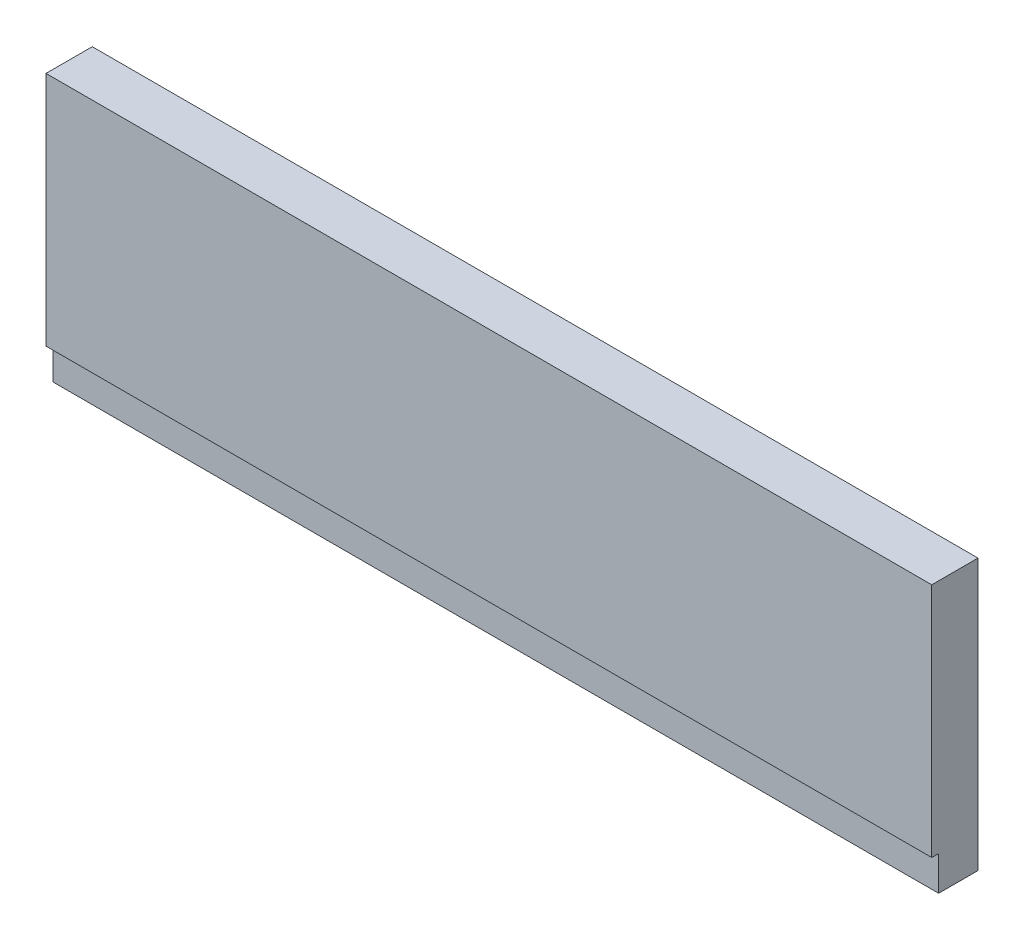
from build123d import *

# Parameters (mm, degrees)
SKETCH_1_W      = 900
SKETCH_1_H      = 240
EXTRUDE_1_DEPTH = 47
SKETCH_2_W      = 900
SKETCH_2_H      = 35
EXTRUDE_2_DEPTH = 40


with BuildPart() as part:
    # Sketch 1 → Extrude 1 (new body)
    with BuildSketch(Plane.XY):
        with Locations((-450, -1906.460757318)):
            Rectangle(SKETCH_1_W, SKETCH_1_H)
    extrude(amount=EXTRUDE_1_DEPTH)

    # Sketch 2 → Extrude 2 (add)
    with BuildSketch(Plane(origin=(0, 0, 0), x_dir=(-1, 0, 0), z_dir=(0, 0, -1))):
        with Locations((450, -2043.960757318)):
            Rectangle(SKETCH_2_W, SKETCH_2_H)
    extrude(amount=-EXTRUDE_2_DEPTH)


solid = part.part
